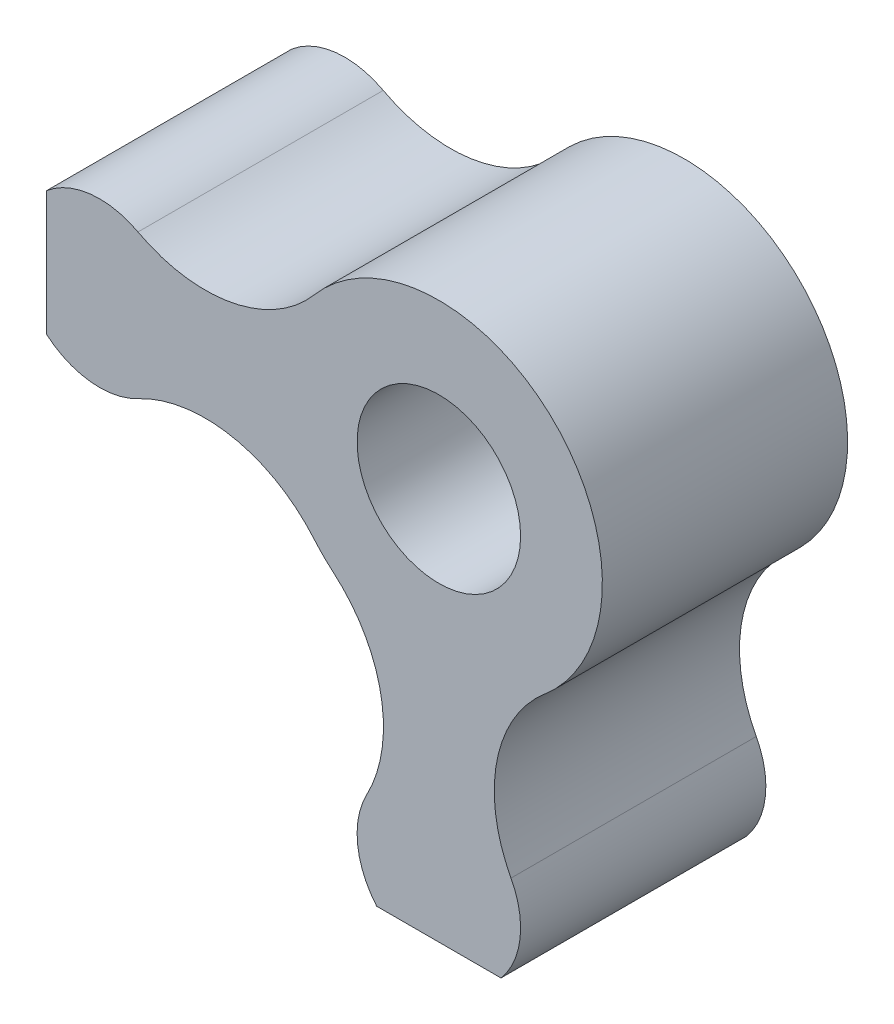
from build123d import *

# Parameters (mm, degrees)
ESQUISSE1_R          = 2
BASE_EXTRUSION_DEPTH = 3


with BuildPart() as part:
    # Esquisse1 → Base-Extrusion (new, symmetric)
    with BuildSketch(Plane.XY):
        with BuildLine():
            Line((-1.519868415, -9.6), (1.519868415, -9.6))
            ThreePointArc((1.519868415, -9.6), (1.988070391, -8.51811951), (1.765577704, -7.360460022))
            ThreePointArc((1.765577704, -7.360460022), (1.417541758, -5.059338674), (2.589513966, -3.048674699))
            ThreePointArc((2.589513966, -3.048674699), (2.828427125, 2.828427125), (-3.048674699, 2.589513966))
            ThreePointArc((-3.048674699, 2.589513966), (-5.059338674, 1.417541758), (-7.360460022, 1.765577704))
            ThreePointArc((-7.360460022, 1.765577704), (-8.51811951, 1.988070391), (-9.6, 1.519868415))
            Line((-9.6, 1.519868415), (-9.6, -1.519868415))
            ThreePointArc((-9.6, -1.519868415), (-8.51811951, -1.988070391), (-7.360460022, -1.765577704))
            ThreePointArc((-7.360460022, -1.765577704), (-5.059338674, -1.417541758), (-3.048674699, -2.589513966))
            ThreePointArc((-3.048674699, -2.589513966), (-2.828427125, -2.828427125), (-2.589513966, -3.048674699))
            ThreePointArc((-2.589513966, -3.048674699), (-1.417541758, -5.059338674), (-1.765577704, -7.360460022))
            ThreePointArc((-1.765577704, -7.360460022), (-1.988070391, -8.51811951), (-1.519868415, -9.6))
        make_face()
        Circle(ESQUISSE1_R, mode=Mode.SUBTRACT)
    extrude(amount=BASE_EXTRUSION_DEPTH, both=True)


solid = part.part
